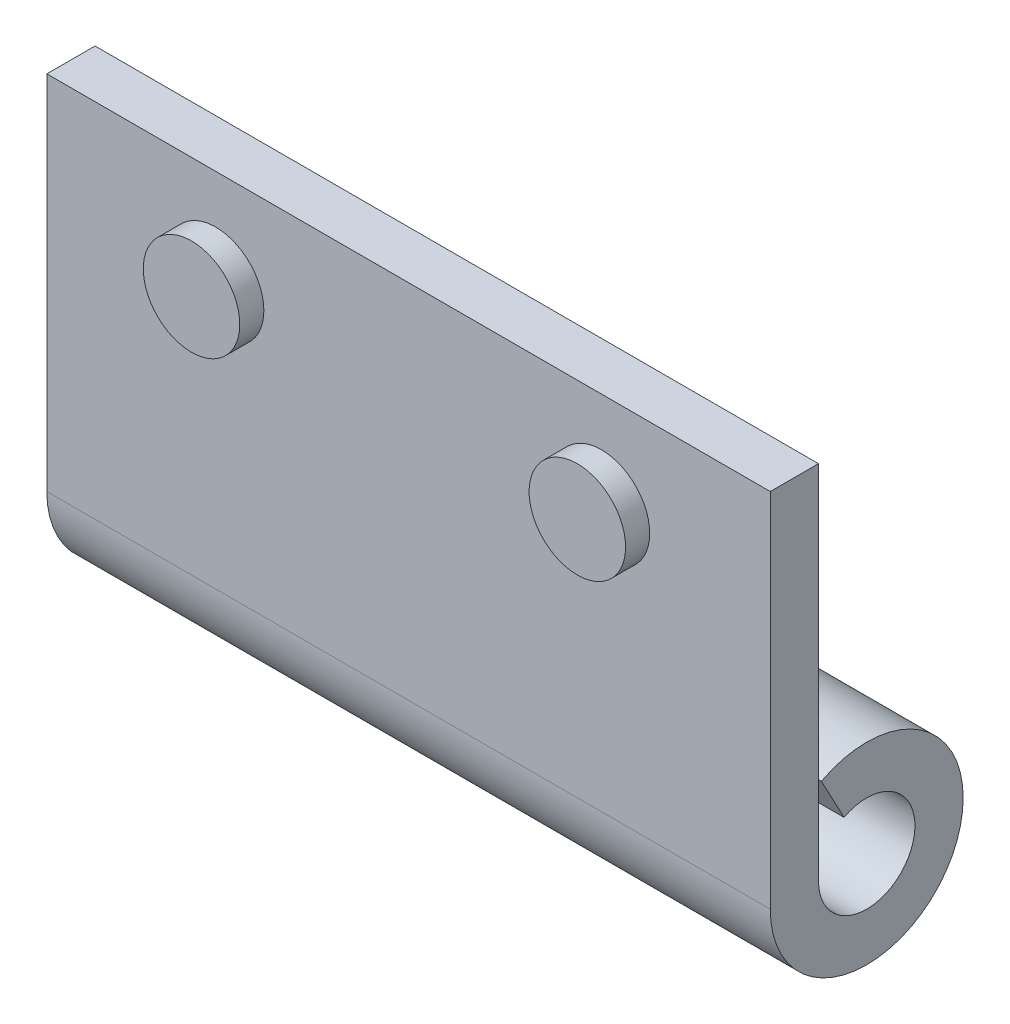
ISO-10303-21;
HEADER;
FILE_DESCRIPTION(('STEP AP214'),'2;1');
FILE_NAME('part.step','',(''),(''),'','','');
FILE_SCHEMA(('AUTOMOTIVE_DESIGN { 1 0 10303 214 1 1 1 1 }'));
ENDSEC;
DATA;
#1=APPLICATION_CONTEXT('core data for automotive mechanical design processes');
#2=APPLICATION_PROTOCOL_DEFINITION('international standard','automotive_design',2000,#1);
#3=PRODUCT_CONTEXT('',#1,'mechanical');
#4=PRODUCT('Part','Part','',(#3));
#5=PRODUCT_RELATED_PRODUCT_CATEGORY('part','',(#4));
#6=PRODUCT_DEFINITION_FORMATION('','',#4);
#7=PRODUCT_DEFINITION_CONTEXT('part definition',#1,'design');
#8=PRODUCT_DEFINITION('design','',#6,#7);
#9=PRODUCT_DEFINITION_SHAPE('','',#8);
#10=(LENGTH_UNIT() NAMED_UNIT(*) SI_UNIT(.MILLI.,.METRE.));
#11=(NAMED_UNIT(*) PLANE_ANGLE_UNIT() SI_UNIT($,.RADIAN.));
#12=(NAMED_UNIT(*) SI_UNIT($,.STERADIAN.) SOLID_ANGLE_UNIT());
#13=UNCERTAINTY_MEASURE_WITH_UNIT(LENGTH_MEASURE(1.E-05),#10,'distance_accuracy_value','');
#14=(GEOMETRIC_REPRESENTATION_CONTEXT(3) GLOBAL_UNCERTAINTY_ASSIGNED_CONTEXT((#13)) GLOBAL_UNIT_ASSIGNED_CONTEXT((#10,
#11,#12)) REPRESENTATION_CONTEXT('',''));
#15=CARTESIAN_POINT('',(0.,0.,0.));
#16=DIRECTION('',(0.,0.,1.));
#17=DIRECTION('',(1.,0.,0.));
#18=AXIS2_PLACEMENT_3D('',#15,#16,#17);
#19=CARTESIAN_POINT('',(15.,0.,4.));
#20=DIRECTION('',(0.,0.,1.));
#21=DIRECTION('',(1.,0.,0.));
#22=AXIS2_PLACEMENT_3D('',#19,#20,#21);
#23=PLANE('',#22);
#24=CARTESIAN_POINT('',(8.,11.,4.));
#25=DIRECTION('',(0.,0.,1.));
#26=DIRECTION('',(1.,0.,0.));
#27=AXIS2_PLACEMENT_3D('',#24,#25,#26);
#28=CIRCLE('',#27,2.);
#29=CARTESIAN_POINT('',(10.,11.,4.));
#30=VERTEX_POINT('',#29);
#31=EDGE_CURVE('E146',#30,#30,#28,.T.);
#32=ORIENTED_EDGE('',*,*,#31,.F.);
#33=EDGE_LOOP('',(#32));
#34=FACE_BOUND('',#33,.T.);
#35=DIRECTION('',(-1.,0.,0.));
#36=VECTOR('',#35,1.);
#37=CARTESIAN_POINT('',(15.,0.,4.));
#38=LINE('',#37,#36);
#39=CARTESIAN_POINT('',(15.,0.,4.));
#40=VERTEX_POINT('',#39);
#41=CARTESIAN_POINT('',(-15.,0.,4.));
#42=VERTEX_POINT('',#41);
#43=EDGE_CURVE('E21',#40,#42,#38,.T.);
#44=ORIENTED_EDGE('',*,*,#43,.F.);
#45=DIRECTION('',(0.,1.,0.));
#46=VECTOR('',#45,1.);
#47=CARTESIAN_POINT('',(15.,0.,4.));
#48=LINE('',#47,#46);
#49=CARTESIAN_POINT('',(15.,15.,4.));
#50=VERTEX_POINT('',#49);
#51=EDGE_CURVE('E73',#40,#50,#48,.T.);
#52=ORIENTED_EDGE('',*,*,#51,.T.);
#53=DIRECTION('',(-1.,0.,0.));
#54=VECTOR('',#53,1.);
#55=CARTESIAN_POINT('',(15.,15.,4.));
#56=LINE('',#55,#54);
#57=CARTESIAN_POINT('',(-15.,15.,4.));
#58=VERTEX_POINT('',#57);
#59=EDGE_CURVE('E9',#50,#58,#56,.T.);
#60=ORIENTED_EDGE('',*,*,#59,.T.);
#61=DIRECTION('',(0.,1.,0.));
#62=VECTOR('',#61,1.);
#63=CARTESIAN_POINT('',(-15.,0.,4.));
#64=LINE('',#63,#62);
#65=EDGE_CURVE('E82',#42,#58,#64,.T.);
#66=ORIENTED_EDGE('',*,*,#65,.F.);
#67=EDGE_LOOP('',(#44,#52,#60,#66));
#68=FACE_BOUND('',#67,.T.);
#69=CARTESIAN_POINT('',(-8.,11.,4.));
#70=DIRECTION('',(0.,0.,1.));
#71=DIRECTION('',(1.,0.,0.));
#72=AXIS2_PLACEMENT_3D('',#69,#70,#71);
#73=CIRCLE('',#72,2.);
#74=CARTESIAN_POINT('',(-6.,11.,4.));
#75=VERTEX_POINT('',#74);
#76=EDGE_CURVE('E152',#75,#75,#73,.T.);
#77=ORIENTED_EDGE('',*,*,#76,.F.);
#78=EDGE_LOOP('',(#77));
#79=FACE_BOUND('',#78,.T.);
#80=ADVANCED_FACE('F14',(#34,#68,#79),#23,.T.);
#81=CARTESIAN_POINT('',(15.,15.,4.));
#82=DIRECTION('',(0.,1.,0.));
#83=DIRECTION('',(-1.,0.,0.));
#84=AXIS2_PLACEMENT_3D('',#81,#82,#83);
#85=PLANE('',#84);
#86=ORIENTED_EDGE('',*,*,#59,.F.);
#87=DIRECTION('',(0.,0.,-1.));
#88=VECTOR('',#87,1.);
#89=CARTESIAN_POINT('',(15.,15.,4.));
#90=LINE('',#89,#88);
#91=CARTESIAN_POINT('',(15.,15.,2.));
#92=VERTEX_POINT('',#91);
#93=EDGE_CURVE('E67',#50,#92,#90,.T.);
#94=ORIENTED_EDGE('',*,*,#93,.T.);
#95=DIRECTION('',(-1.,0.,0.));
#96=VECTOR('',#95,1.);
#97=CARTESIAN_POINT('',(15.,15.,2.));
#98=LINE('',#97,#96);
#99=CARTESIAN_POINT('',(-15.,15.,2.));
#100=VERTEX_POINT('',#99);
#101=EDGE_CURVE('E62',#92,#100,#98,.T.);
#102=ORIENTED_EDGE('',*,*,#101,.T.);
#103=DIRECTION('',(0.,0.,-1.));
#104=VECTOR('',#103,1.);
#105=CARTESIAN_POINT('',(-15.,15.,4.));
#106=LINE('',#105,#104);
#107=EDGE_CURVE('E65',#58,#100,#106,.T.);
#108=ORIENTED_EDGE('',*,*,#107,.F.);
#109=EDGE_LOOP('',(#86,#94,#102,#108));
#110=FACE_BOUND('',#109,.T.);
#111=ADVANCED_FACE('F64',(#110),#85,.T.);
#112=CARTESIAN_POINT('',(15.,0.,0.));
#113=DIRECTION('',(-1.,0.,0.));
#114=DIRECTION('',(0.,-1.,0.));
#115=AXIS2_PLACEMENT_3D('',#112,#113,#114);
#116=CYLINDRICAL_SURFACE('',#115,4.);
#117=DIRECTION('',(-1.,0.,0.));
#118=VECTOR('',#117,1.);
#119=CARTESIAN_POINT('',(15.,3.5317903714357,1.87788625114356));
#120=LINE('',#119,#118);
#121=CARTESIAN_POINT('',(15.,3.5317903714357,1.87788625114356));
#122=VERTEX_POINT('',#121);
#123=CARTESIAN_POINT('',(-15.,3.5317903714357,1.87788625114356));
#124=VERTEX_POINT('',#123);
#125=EDGE_CURVE('E114',#122,#124,#120,.T.);
#126=ORIENTED_EDGE('',*,*,#125,.F.);
#127=CARTESIAN_POINT('',(15.,0.,0.));
#128=DIRECTION('',(1.,0.,0.));
#129=DIRECTION('',(0.,1.,0.));
#130=AXIS2_PLACEMENT_3D('',#127,#128,#129);
#131=CIRCLE('',#130,4.);
#132=EDGE_CURVE('E107',#40,#122,#131,.T.);
#133=ORIENTED_EDGE('',*,*,#132,.F.);
#134=ORIENTED_EDGE('',*,*,#43,.T.);
#135=CARTESIAN_POINT('',(-15.,0.,0.));
#136=DIRECTION('',(1.,0.,0.));
#137=DIRECTION('',(0.,1.,0.));
#138=AXIS2_PLACEMENT_3D('',#135,#136,#137);
#139=CIRCLE('',#138,4.);
#140=EDGE_CURVE('E94',#42,#124,#139,.T.);
#141=ORIENTED_EDGE('',*,*,#140,.T.);
#142=EDGE_LOOP('',(#126,#133,#134,#141));
#143=FACE_BOUND('',#142,.T.);
#144=ADVANCED_FACE('F116',(#143),#116,.T.);
#145=CARTESIAN_POINT('',(15.,3.5317903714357,1.87788625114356));
#146=DIRECTION('',(0.,0.469471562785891,-0.882947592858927));
#147=DIRECTION('',(0.,0.882947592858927,0.469471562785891));
#148=AXIS2_PLACEMENT_3D('',#145,#146,#147);
#149=PLANE('',#148);
#150=DIRECTION('',(-1.,0.,0.));
#151=VECTOR('',#150,1.);
#152=CARTESIAN_POINT('',(15.,1.76589518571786,0.938943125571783));
#153=LINE('',#152,#151);
#154=CARTESIAN_POINT('',(15.,1.76589518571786,0.938943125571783));
#155=VERTEX_POINT('',#154);
#156=CARTESIAN_POINT('',(-15.,1.76589518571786,0.938943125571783));
#157=VERTEX_POINT('',#156);
#158=EDGE_CURVE('E112',#155,#157,#153,.T.);
#159=ORIENTED_EDGE('',*,*,#158,.F.);
#160=DIRECTION('',(0.,-0.882947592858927,-0.469471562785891));
#161=VECTOR('',#160,1.);
#162=CARTESIAN_POINT('',(15.,3.5317903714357,1.87788625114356));
#163=LINE('',#162,#161);
#164=EDGE_CURVE('E104',#122,#155,#163,.T.);
#165=ORIENTED_EDGE('',*,*,#164,.F.);
#166=ORIENTED_EDGE('',*,*,#125,.T.);
#167=DIRECTION('',(0.,-0.882947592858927,-0.469471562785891));
#168=VECTOR('',#167,1.);
#169=CARTESIAN_POINT('',(-15.,3.5317903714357,1.87788625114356));
#170=LINE('',#169,#168);
#171=EDGE_CURVE('E88',#124,#157,#170,.T.);
#172=ORIENTED_EDGE('',*,*,#171,.T.);
#173=EDGE_LOOP('',(#159,#165,#166,#172));
#174=FACE_BOUND('',#173,.T.);
#175=ADVANCED_FACE('F127',(#174),#149,.F.);
#176=CARTESIAN_POINT('',(15.,0.,0.));
#177=DIRECTION('',(-1.,0.,0.));
#178=DIRECTION('',(0.,-1.,0.));
#179=AXIS2_PLACEMENT_3D('',#176,#177,#178);
#180=CYLINDRICAL_SURFACE('',#179,2.);
#181=DIRECTION('',(-1.,0.,0.));
#182=VECTOR('',#181,1.);
#183=CARTESIAN_POINT('',(15.,0.,2.));
#184=LINE('',#183,#182);
#185=CARTESIAN_POINT('',(15.,0.,2.));
#186=VERTEX_POINT('',#185);
#187=CARTESIAN_POINT('',(-15.,0.,2.));
#188=VERTEX_POINT('',#187);
#189=EDGE_CURVE('E72',#186,#188,#184,.T.);
#190=ORIENTED_EDGE('',*,*,#189,.F.);
#191=CARTESIAN_POINT('',(15.,0.,0.));
#192=DIRECTION('',(1.,0.,0.));
#193=DIRECTION('',(0.,1.,0.));
#194=AXIS2_PLACEMENT_3D('',#191,#192,#193);
#195=CIRCLE('',#194,2.);
#196=EDGE_CURVE('E101',#186,#155,#195,.T.);
#197=ORIENTED_EDGE('',*,*,#196,.T.);
#198=ORIENTED_EDGE('',*,*,#158,.T.);
#199=CARTESIAN_POINT('',(-15.,0.,0.));
#200=DIRECTION('',(1.,0.,0.));
#201=DIRECTION('',(0.,1.,0.));
#202=AXIS2_PLACEMENT_3D('',#199,#200,#201);
#203=CIRCLE('',#202,2.);
#204=EDGE_CURVE('E86',#188,#157,#203,.T.);
#205=ORIENTED_EDGE('',*,*,#204,.F.);
#206=EDGE_LOOP('',(#190,#197,#198,#205));
#207=FACE_BOUND('',#206,.T.);
#208=ADVANCED_FACE('F125',(#207),#180,.F.);
#209=CARTESIAN_POINT('',(15.,0.,2.));
#210=DIRECTION('',(0.,0.,1.));
#211=DIRECTION('',(1.,0.,0.));
#212=AXIS2_PLACEMENT_3D('',#209,#210,#211);
#213=PLANE('',#212);
#214=CARTESIAN_POINT('',(8.,11.,2.));
#215=DIRECTION('',(0.,0.,-1.));
#216=DIRECTION('',(-1.,0.,0.));
#217=AXIS2_PLACEMENT_3D('',#214,#215,#216);
#218=CIRCLE('',#217,2.);
#219=CARTESIAN_POINT('',(6.,11.,2.));
#220=VERTEX_POINT('',#219);
#221=EDGE_CURVE('E166',#220,#220,#218,.T.);
#222=ORIENTED_EDGE('',*,*,#221,.F.);
#223=EDGE_LOOP('',(#222));
#224=FACE_BOUND('',#223,.T.);
#225=CARTESIAN_POINT('',(-8.,11.,2.));
#226=DIRECTION('',(0.,0.,-1.));
#227=DIRECTION('',(-1.,0.,0.));
#228=AXIS2_PLACEMENT_3D('',#225,#226,#227);
#229=CIRCLE('',#228,2.);
#230=CARTESIAN_POINT('',(-10.,11.,2.));
#231=VERTEX_POINT('',#230);
#232=EDGE_CURVE('E160',#231,#231,#229,.T.);
#233=ORIENTED_EDGE('',*,*,#232,.F.);
#234=EDGE_LOOP('',(#233));
#235=FACE_BOUND('',#234,.T.);
#236=DIRECTION('',(0.,1.,0.));
#237=VECTOR('',#236,1.);
#238=CARTESIAN_POINT('',(15.,0.,2.));
#239=LINE('',#238,#237);
#240=EDGE_CURVE('E99',#186,#92,#239,.T.);
#241=ORIENTED_EDGE('',*,*,#240,.F.);
#242=ORIENTED_EDGE('',*,*,#189,.T.);
#243=DIRECTION('',(0.,1.,0.));
#244=VECTOR('',#243,1.);
#245=CARTESIAN_POINT('',(-15.,0.,2.));
#246=LINE('',#245,#244);
#247=EDGE_CURVE('E79',#188,#100,#246,.T.);
#248=ORIENTED_EDGE('',*,*,#247,.T.);
#249=ORIENTED_EDGE('',*,*,#101,.F.);
#250=EDGE_LOOP('',(#241,#242,#248,#249));
#251=FACE_BOUND('',#250,.T.);
#252=ADVANCED_FACE('F85',(#224,#235,#251),#213,.F.);
#253=CARTESIAN_POINT('',(15.,0.,0.));
#254=DIRECTION('',(1.,0.,0.));
#255=DIRECTION('',(0.,1.,0.));
#256=AXIS2_PLACEMENT_3D('',#253,#254,#255);
#257=PLANE('',#256);
#258=ORIENTED_EDGE('',*,*,#93,.F.);
#259=ORIENTED_EDGE('',*,*,#51,.F.);
#260=ORIENTED_EDGE('',*,*,#132,.T.);
#261=ORIENTED_EDGE('',*,*,#164,.T.);
#262=ORIENTED_EDGE('',*,*,#196,.F.);
#263=ORIENTED_EDGE('',*,*,#240,.T.);
#264=EDGE_LOOP('',(#258,#259,#260,#261,#262,#263));
#265=FACE_BOUND('',#264,.T.);
#266=ADVANCED_FACE('F121',(#265),#257,.T.);
#267=CARTESIAN_POINT('',(-15.,0.,0.));
#268=DIRECTION('',(1.,0.,0.));
#269=DIRECTION('',(0.,1.,0.));
#270=AXIS2_PLACEMENT_3D('',#267,#268,#269);
#271=PLANE('',#270);
#272=ORIENTED_EDGE('',*,*,#107,.T.);
#273=ORIENTED_EDGE('',*,*,#247,.F.);
#274=ORIENTED_EDGE('',*,*,#204,.T.);
#275=ORIENTED_EDGE('',*,*,#171,.F.);
#276=ORIENTED_EDGE('',*,*,#140,.F.);
#277=ORIENTED_EDGE('',*,*,#65,.T.);
#278=EDGE_LOOP('',(#272,#273,#274,#275,#276,#277));
#279=FACE_BOUND('',#278,.T.);
#280=ADVANCED_FACE('F77',(#279),#271,.F.);
#281=CARTESIAN_POINT('',(8.,11.,5.));
#282=DIRECTION('',(0.,0.,-1.));
#283=DIRECTION('',(-1.,0.,0.));
#284=AXIS2_PLACEMENT_3D('',#281,#282,#283);
#285=CYLINDRICAL_SURFACE('',#284,2.);
#286=CARTESIAN_POINT('',(8.,11.,5.));
#287=DIRECTION('',(0.,0.,1.));
#288=DIRECTION('',(1.,0.,0.));
#289=AXIS2_PLACEMENT_3D('',#286,#287,#288);
#290=CIRCLE('',#289,2.);
#291=CARTESIAN_POINT('',(10.,11.,5.));
#292=VERTEX_POINT('',#291);
#293=EDGE_CURVE('E83',#292,#292,#290,.T.);
#294=ORIENTED_EDGE('',*,*,#293,.F.);
#295=EDGE_LOOP('',(#294));
#296=FACE_BOUND('',#295,.T.);
#297=ORIENTED_EDGE('',*,*,#31,.T.);
#298=EDGE_LOOP('',(#297));
#299=FACE_BOUND('',#298,.T.);
#300=ADVANCED_FACE('F194',(#296,#299),#285,.T.);
#301=CARTESIAN_POINT('',(8.,11.,5.));
#302=DIRECTION('',(0.,0.,1.));
#303=DIRECTION('',(1.,0.,0.));
#304=AXIS2_PLACEMENT_3D('',#301,#302,#303);
#305=PLANE('',#304);
#306=ORIENTED_EDGE('',*,*,#293,.T.);
#307=EDGE_LOOP('',(#306));
#308=FACE_BOUND('',#307,.T.);
#309=ADVANCED_FACE('F243',(#308),#305,.T.);
#310=CARTESIAN_POINT('',(-8.,11.,5.));
#311=DIRECTION('',(0.,0.,-1.));
#312=DIRECTION('',(-1.,0.,0.));
#313=AXIS2_PLACEMENT_3D('',#310,#311,#312);
#314=CYLINDRICAL_SURFACE('',#313,2.);
#315=CARTESIAN_POINT('',(-8.,11.,5.));
#316=DIRECTION('',(0.,0.,1.));
#317=DIRECTION('',(1.,0.,0.));
#318=AXIS2_PLACEMENT_3D('',#315,#316,#317);
#319=CIRCLE('',#318,2.);
#320=CARTESIAN_POINT('',(-6.,11.,5.));
#321=VERTEX_POINT('',#320);
#322=EDGE_CURVE('E148',#321,#321,#319,.T.);
#323=ORIENTED_EDGE('',*,*,#322,.F.);
#324=EDGE_LOOP('',(#323));
#325=FACE_BOUND('',#324,.T.);
#326=ORIENTED_EDGE('',*,*,#76,.T.);
#327=EDGE_LOOP('',(#326));
#328=FACE_BOUND('',#327,.T.);
#329=ADVANCED_FACE('F191',(#325,#328),#314,.T.);
#330=CARTESIAN_POINT('',(-8.,11.,5.));
#331=DIRECTION('',(0.,0.,1.));
#332=DIRECTION('',(1.,0.,0.));
#333=AXIS2_PLACEMENT_3D('',#330,#331,#332);
#334=PLANE('',#333);
#335=ORIENTED_EDGE('',*,*,#322,.T.);
#336=EDGE_LOOP('',(#335));
#337=FACE_BOUND('',#336,.T.);
#338=ADVANCED_FACE('F180',(#337),#334,.T.);
#339=CARTESIAN_POINT('',(-8.,11.,3.));
#340=DIRECTION('',(0.,0.,-1.));
#341=DIRECTION('',(-1.,0.,0.));
#342=AXIS2_PLACEMENT_3D('',#339,#340,#341);
#343=CYLINDRICAL_SURFACE('',#342,2.);
#344=CARTESIAN_POINT('',(-8.,11.,3.));
#345=DIRECTION('',(0.,0.,-1.));
#346=DIRECTION('',(-1.,0.,0.));
#347=AXIS2_PLACEMENT_3D('',#344,#345,#346);
#348=CIRCLE('',#347,2.);
#349=CARTESIAN_POINT('',(-10.,11.,3.));
#350=VERTEX_POINT('',#349);
#351=EDGE_CURVE('E157',#350,#350,#348,.T.);
#352=ORIENTED_EDGE('',*,*,#351,.F.);
#353=EDGE_LOOP('',(#352));
#354=FACE_BOUND('',#353,.T.);
#355=ORIENTED_EDGE('',*,*,#232,.T.);
#356=EDGE_LOOP('',(#355));
#357=FACE_BOUND('',#356,.T.);
#358=ADVANCED_FACE('F177',(#354,#357),#343,.F.);
#359=CARTESIAN_POINT('',(-8.,11.,3.));
#360=DIRECTION('',(0.,0.,-1.));
#361=DIRECTION('',(-1.,0.,0.));
#362=AXIS2_PLACEMENT_3D('',#359,#360,#361);
#363=PLANE('',#362);
#364=ORIENTED_EDGE('',*,*,#351,.T.);
#365=EDGE_LOOP('',(#364));
#366=FACE_BOUND('',#365,.T.);
#367=ADVANCED_FACE('F179',(#366),#363,.T.);
#368=CARTESIAN_POINT('',(8.,11.,3.));
#369=DIRECTION('',(0.,0.,-1.));
#370=DIRECTION('',(-1.,0.,0.));
#371=AXIS2_PLACEMENT_3D('',#368,#369,#370);
#372=CYLINDRICAL_SURFACE('',#371,2.);
#373=CARTESIAN_POINT('',(8.,11.,3.));
#374=DIRECTION('',(0.,0.,-1.));
#375=DIRECTION('',(-1.,0.,0.));
#376=AXIS2_PLACEMENT_3D('',#373,#374,#375);
#377=CIRCLE('',#376,2.);
#378=CARTESIAN_POINT('',(6.,11.,3.));
#379=VERTEX_POINT('',#378);
#380=EDGE_CURVE('E163',#379,#379,#377,.T.);
#381=ORIENTED_EDGE('',*,*,#380,.F.);
#382=EDGE_LOOP('',(#381));
#383=FACE_BOUND('',#382,.T.);
#384=ORIENTED_EDGE('',*,*,#221,.T.);
#385=EDGE_LOOP('',(#384));
#386=FACE_BOUND('',#385,.T.);
#387=ADVANCED_FACE('F170',(#383,#386),#372,.F.);
#388=CARTESIAN_POINT('',(8.,11.,3.));
#389=DIRECTION('',(0.,0.,-1.));
#390=DIRECTION('',(-1.,0.,0.));
#391=AXIS2_PLACEMENT_3D('',#388,#389,#390);
#392=PLANE('',#391);
#393=ORIENTED_EDGE('',*,*,#380,.T.);
#394=EDGE_LOOP('',(#393));
#395=FACE_BOUND('',#394,.T.);
#396=ADVANCED_FACE('F183',(#395),#392,.T.);
#397=CLOSED_SHELL('',(#80,#111,#144,#175,#208,#252,#266,#280,#300,#309,#329,#338,#358,#367,#387,#396));
#398=MANIFOLD_SOLID_BREP('B1',#397);
#399=ADVANCED_BREP_SHAPE_REPRESENTATION('',(#18,#398),#14);
#400=SHAPE_DEFINITION_REPRESENTATION(#9,#399);
ENDSEC;
END-ISO-10303-21;
